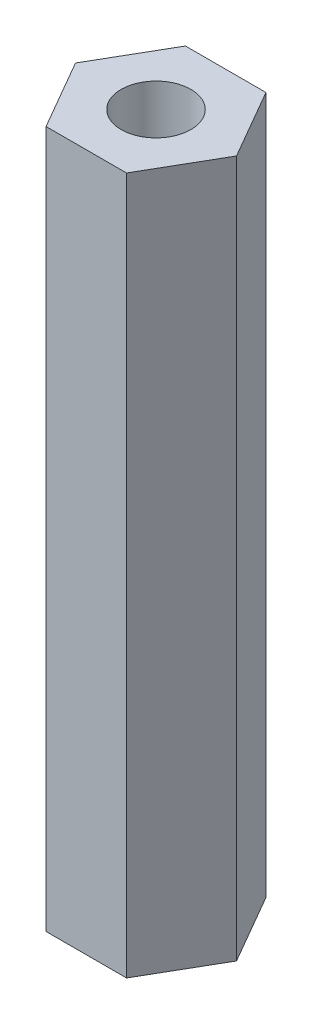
from build123d import *

# Parameters (mm, degrees)
SKETCH_1_R      = 1.5
EXTRUDE_1_DEPTH = 30


with BuildPart() as part:
    # Sketch 1 → Extrude 1 (new body)
    with BuildSketch(Plane(origin=(0, 0, 0), x_dir=(1, 0, 0), z_dir=(0, 1, 0))):
        Polygon((3.464101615, 0), (1.732050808, 3), (-1.732050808, 3), (-3.464101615, 0), (-1.732050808, -3), (1.732050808, -3), align=None)
        with Locations(Location((0, 0, 0), (0, 0, 270))):
            Circle(SKETCH_1_R, mode=Mode.SUBTRACT)
    extrude(amount=EXTRUDE_1_DEPTH)


solid = part.part
